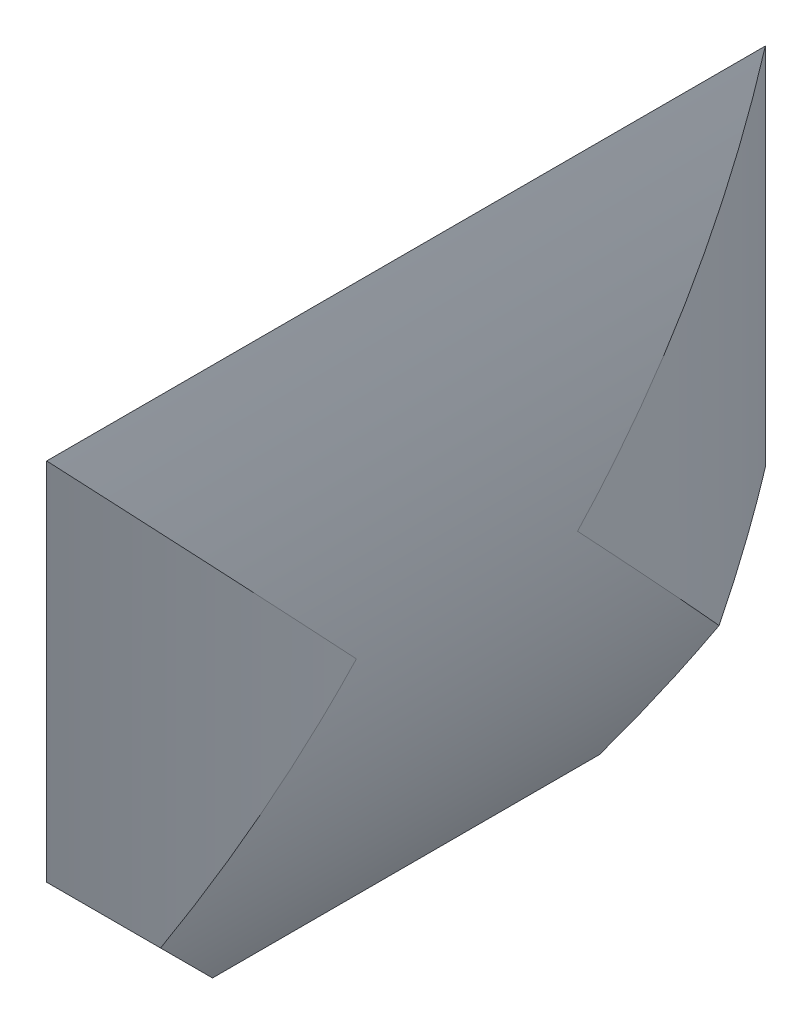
from build123d import *

# Parameters (mm, degrees)
EXTRUDE1_DEPTH          = 165.1
CUT_EXTRUDE1_DEPTH      = 25.4
CUT_EXTRUDE1_DEPTH_BACK = 25.4
CUT_EXTRUDE2_DEPTH      = 101.6
CUT_EXTRUDE2_DEPTH_BACK = 101.6
SKETCH3_OUTSIDE_W       = 71.432
SKETCH3_OUTSIDE_H       = 208.528
EXTRUDE2_DEPTH          = 2.54
EXTRUDE2_DEPTH_BACK     = 6.35
SKETCH8_R               = 3.96875


with BuildPart() as part:
    # Sketch1 → Extrude1 (new body)
    with BuildSketch(Plane.XY):
        with BuildLine():
            ThreePointArc((0, -60.96), (14.002074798, 0), (0, 60.96))
            ThreePointArc((0, 60.96), (-14.002074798, 0), (0, -60.96))
        make_face()
    extrude(amount=EXTRUDE1_DEPTH)

    # Sketch2 → Cut-Extrude1 (cut, two sides: drawn at the far end of the back side and taken through both)
    with BuildSketch(Plane(origin=(0, 0, 0), x_dir=(0, 0, -1), z_dir=(1, 0, 0)).offset(-CUT_EXTRUDE1_DEPTH_BACK)):
        Polygon((-127, -60.96), (-165.1, -22.86), (-165.1, -60.96), align=None)
        Polygon((0, -60.96), (-38.1, -60.96), (0, -22.86), align=None)
    extrude(amount=CUT_EXTRUDE1_DEPTH + CUT_EXTRUDE1_DEPTH_BACK, mode=Mode.SUBTRACT)

    # Sketch3 outside → Cut-Extrude2 (cut, two sides: drawn at the far end of the back side and taken through both)
    with BuildSketch(Plane(origin=(0, 0, 0), x_dir=(1, 0, 0), z_dir=(0, 1, 0)).offset(-CUT_EXTRUDE2_DEPTH_BACK)):
        with Locations((0, -82.55)):
            Rectangle(SKETCH3_OUTSIDE_W, SKETCH3_OUTSIDE_H)
        with BuildLine():
            Line((-14.002074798, -57.15), (-14.002074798, -107.95))
            ThreePointArc((-14.002074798, -107.95), (-10.450543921, -137.370148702), (0, -165.1))
            ThreePointArc((0, -165.1), (10.450543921, -137.370148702), (14.002074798, -107.95))
            Line((14.002074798, -107.95), (14.002074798, -57.15))
            ThreePointArc((14.002074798, -57.15), (10.450543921, -27.729851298), (0, 0))
            ThreePointArc((0, 0), (-10.450543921, -27.729851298), (-14.002074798, -57.15))
        make_face(mode=Mode.SUBTRACT)
    extrude(amount=CUT_EXTRUDE2_DEPTH + CUT_EXTRUDE2_DEPTH_BACK, mode=Mode.SUBTRACT)


with BuildPart() as cut_extrude2_kept_piece:
    # of the separate pieces the step leaves, the one the design keeps (cut_extrude2_pieces_kept)
    add(part.part.solids().sort_by_distance((0, 60.96, 0))[0])

    # Sketch8 → Extrude2 (add, two sides: drawn at the far end of the back side and taken through both)
    with BuildSketch(Plane(origin=(-21.955624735, -9.338076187, 0), x_dir=(0, 0, -1), z_dir=(0.9202262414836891, 0.3913868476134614, 0)).offset(-EXTRUDE2_DEPTH_BACK)):
        with Locations(Location((-82.55, -44.410118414, 0), (0, 0, 90))):
            Circle(SKETCH8_R)
    extrude(amount=EXTRUDE2_DEPTH + EXTRUDE2_DEPTH_BACK)


solid = cut_extrude2_kept_piece.part
